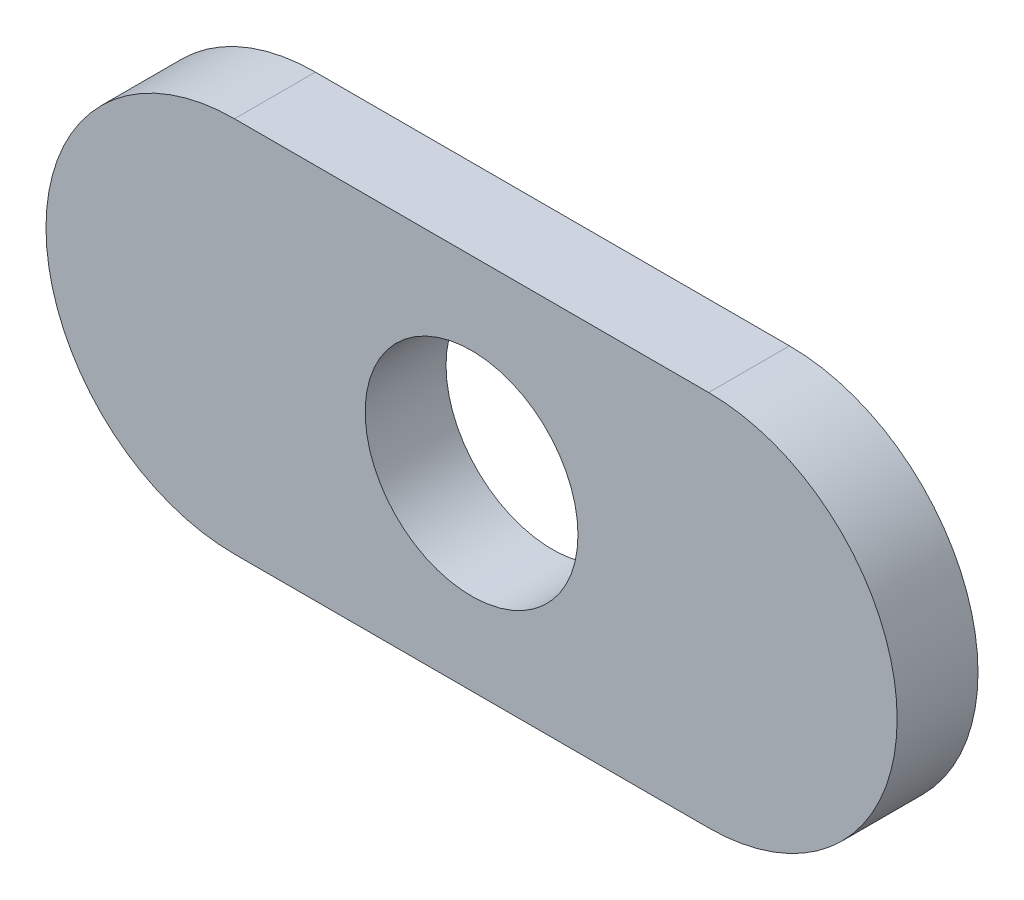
from build123d import *

# Parameters (mm, degrees)
EXTRUDE1_DEPTH     = 2.413
CUT_EXTRUDE1_REACH = 187.711
SKETCH4_R          = 3.175


with BuildPart() as part:
    # Sketch1 → Extrude1 (new body)
    with BuildSketch(Plane.XY):
        with BuildLine():
            Line((111.27866266, 131.559165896), (125.42646266, 131.559165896))
            ThreePointArc((125.42646266, 131.559165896), (131.05256266, 125.933065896), (125.42646266, 120.306965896))
            Line((125.42646266, 120.306965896), (111.27866266, 120.306965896))
            ThreePointArc((111.27866266, 120.306965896), (105.65256266, 125.933065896), (111.27866266, 131.559165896))
        make_face()
    extrude(amount=EXTRUDE1_DEPTH)

    # Sketch4 → Cut-Extrude1 (cut, up to next)
    with BuildSketch(Plane.XY.offset(2.413), mode=Mode.PRIVATE) as cut_extrude1_sk1:
        with Locations((118.35256266, 125.933065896)):
            Circle(SKETCH4_R)
    cut_extrude1_tool1 = extrude(cut_extrude1_sk1.sketch, amount=-CUT_EXTRUDE1_REACH, mode=Mode.PRIVATE) & part.part
    add(cut_extrude1_tool1.solids().sort_by_distance((118.352563, 125.933066, 2.413))[0], mode=Mode.SUBTRACT)


solid = part.part
